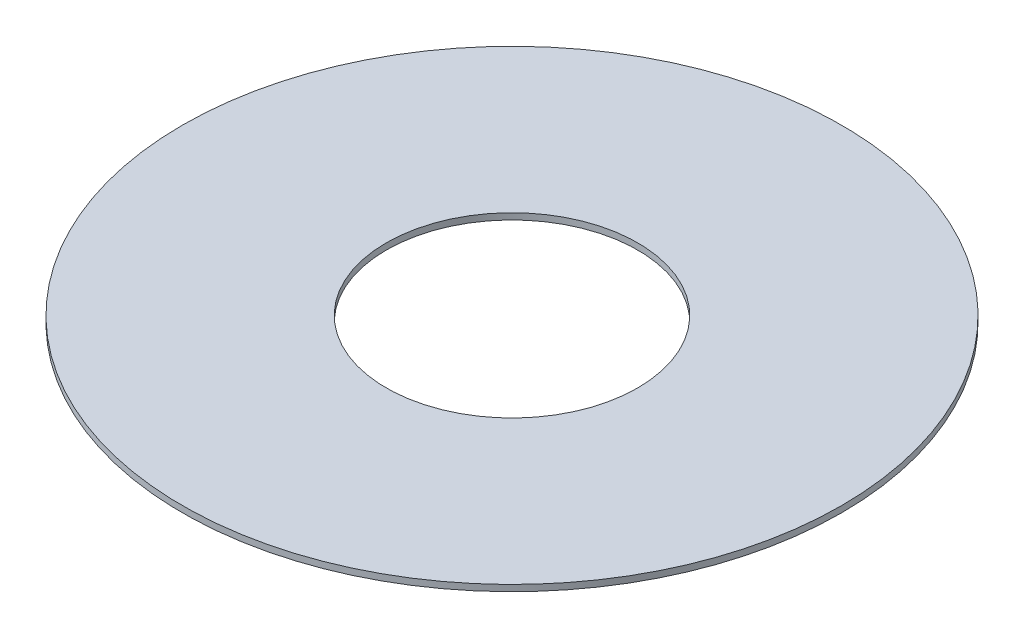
ISO-10303-21;
HEADER;
FILE_DESCRIPTION(('STEP AP214'),'2;1');
FILE_NAME('part.step','',(''),(''),'','','');
FILE_SCHEMA(('AUTOMOTIVE_DESIGN { 1 0 10303 214 1 1 1 1 }'));
ENDSEC;
DATA;
#1=APPLICATION_CONTEXT('core data for automotive mechanical design processes');
#2=APPLICATION_PROTOCOL_DEFINITION('international standard','automotive_design',2000,#1);
#3=PRODUCT_CONTEXT('',#1,'mechanical');
#4=PRODUCT('Part','Part','',(#3));
#5=PRODUCT_RELATED_PRODUCT_CATEGORY('part','',(#4));
#6=PRODUCT_DEFINITION_FORMATION('','',#4);
#7=PRODUCT_DEFINITION_CONTEXT('part definition',#1,'design');
#8=PRODUCT_DEFINITION('design','',#6,#7);
#9=PRODUCT_DEFINITION_SHAPE('','',#8);
#10=(LENGTH_UNIT() NAMED_UNIT(*) SI_UNIT(.MILLI.,.METRE.));
#11=(NAMED_UNIT(*) PLANE_ANGLE_UNIT() SI_UNIT($,.RADIAN.));
#12=(NAMED_UNIT(*) SI_UNIT($,.STERADIAN.) SOLID_ANGLE_UNIT());
#13=UNCERTAINTY_MEASURE_WITH_UNIT(LENGTH_MEASURE(1.E-05),#10,'distance_accuracy_value','');
#14=(GEOMETRIC_REPRESENTATION_CONTEXT(3) GLOBAL_UNCERTAINTY_ASSIGNED_CONTEXT((#13)) GLOBAL_UNIT_ASSIGNED_CONTEXT((#10,
#11,#12)) REPRESENTATION_CONTEXT('',''));
#15=CARTESIAN_POINT('',(0.,0.,0.));
#16=DIRECTION('',(0.,0.,1.));
#17=DIRECTION('',(1.,0.,0.));
#18=AXIS2_PLACEMENT_3D('',#15,#16,#17);
#19=CARTESIAN_POINT('',(0.,0.,0.));
#20=DIRECTION('',(0.,-1.,0.));
#21=DIRECTION('',(1.,0.,0.));
#22=AXIS2_PLACEMENT_3D('',#19,#20,#21);
#23=CYLINDRICAL_SURFACE('',#22,9.99999999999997);
#24=CARTESIAN_POINT('',(0.,8.25000000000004,0.));
#25=DIRECTION('',(0.,-1.,0.));
#26=DIRECTION('',(1.,0.,0.));
#27=AXIS2_PLACEMENT_3D('',#24,#25,#26);
#28=CIRCLE('',#27,9.99999999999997);
#29=CARTESIAN_POINT('',(10.,8.25,0.));
#30=VERTEX_POINT('',#29);
#31=EDGE_CURVE('E10',#30,#30,#28,.T.);
#32=ORIENTED_EDGE('',*,*,#31,.T.);
#33=EDGE_LOOP('',(#32));
#34=FACE_BOUND('',#33,.T.);
#35=CARTESIAN_POINT('',(0.,8.75000000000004,0.));
#36=DIRECTION('',(0.,-1.,0.));
#37=DIRECTION('',(1.,0.,0.));
#38=AXIS2_PLACEMENT_3D('',#35,#36,#37);
#39=CIRCLE('',#38,9.99999999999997);
#40=CARTESIAN_POINT('',(10.,8.75,0.));
#41=VERTEX_POINT('',#40);
#42=EDGE_CURVE('E45',#41,#41,#39,.T.);
#43=ORIENTED_EDGE('',*,*,#42,.F.);
#44=EDGE_LOOP('',(#43));
#45=FACE_BOUND('',#44,.T.);
#46=ADVANCED_FACE('F29',(#34,#45),#23,.F.);
#47=CARTESIAN_POINT('',(10.,8.25000000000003,0.));
#48=DIRECTION('',(0.,-1.,0.));
#49=DIRECTION('',(1.,0.,0.));
#50=AXIS2_PLACEMENT_3D('',#47,#48,#49);
#51=PLANE('',#50);
#52=CARTESIAN_POINT('',(0.,8.25000000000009,0.));
#53=DIRECTION('',(0.,-1.,0.));
#54=DIRECTION('',(1.,0.,0.));
#55=AXIS2_PLACEMENT_3D('',#52,#53,#54);
#56=CIRCLE('',#55,26.2124546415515);
#57=CARTESIAN_POINT('',(26.2124546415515,8.25,0.));
#58=VERTEX_POINT('',#57);
#59=EDGE_CURVE('E36',#58,#58,#56,.T.);
#60=ORIENTED_EDGE('',*,*,#59,.T.);
#61=EDGE_LOOP('',(#60));
#62=FACE_BOUND('',#61,.T.);
#63=ORIENTED_EDGE('',*,*,#31,.F.);
#64=EDGE_LOOP('',(#63));
#65=FACE_BOUND('',#64,.T.);
#66=ADVANCED_FACE('F55',(#62,#65),#51,.T.);
#67=CARTESIAN_POINT('',(0.,0.,0.));
#68=DIRECTION('',(0.,-1.,0.));
#69=DIRECTION('',(1.,0.,0.));
#70=AXIS2_PLACEMENT_3D('',#67,#68,#69);
#71=CYLINDRICAL_SURFACE('',#70,26.2124546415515);
#72=CARTESIAN_POINT('',(0.,8.75000000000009,0.));
#73=DIRECTION('',(0.,-1.,0.));
#74=DIRECTION('',(1.,0.,0.));
#75=AXIS2_PLACEMENT_3D('',#72,#73,#74);
#76=CIRCLE('',#75,26.2124546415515);
#77=CARTESIAN_POINT('',(26.2124546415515,8.75,0.));
#78=VERTEX_POINT('',#77);
#79=EDGE_CURVE('E41',#78,#78,#76,.T.);
#80=ORIENTED_EDGE('',*,*,#79,.T.);
#81=EDGE_LOOP('',(#80));
#82=FACE_BOUND('',#81,.T.);
#83=ORIENTED_EDGE('',*,*,#59,.F.);
#84=EDGE_LOOP('',(#83));
#85=FACE_BOUND('',#84,.T.);
#86=ADVANCED_FACE('F59',(#82,#85),#71,.T.);
#87=CARTESIAN_POINT('',(10.,8.75000000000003,0.));
#88=DIRECTION('',(0.,1.,0.));
#89=DIRECTION('',(-1.,0.,0.));
#90=AXIS2_PLACEMENT_3D('',#87,#88,#89);
#91=PLANE('',#90);
#92=ORIENTED_EDGE('',*,*,#42,.T.);
#93=EDGE_LOOP('',(#92));
#94=FACE_BOUND('',#93,.T.);
#95=ORIENTED_EDGE('',*,*,#79,.F.);
#96=EDGE_LOOP('',(#95));
#97=FACE_BOUND('',#96,.T.);
#98=ADVANCED_FACE('F51',(#94,#97),#91,.T.);
#99=CLOSED_SHELL('',(#46,#66,#86,#98));
#100=MANIFOLD_SOLID_BREP('B2',#99);
#101=ADVANCED_BREP_SHAPE_REPRESENTATION('',(#18,#100),#14);
#102=SHAPE_DEFINITION_REPRESENTATION(#9,#101);
ENDSEC;
END-ISO-10303-21;
